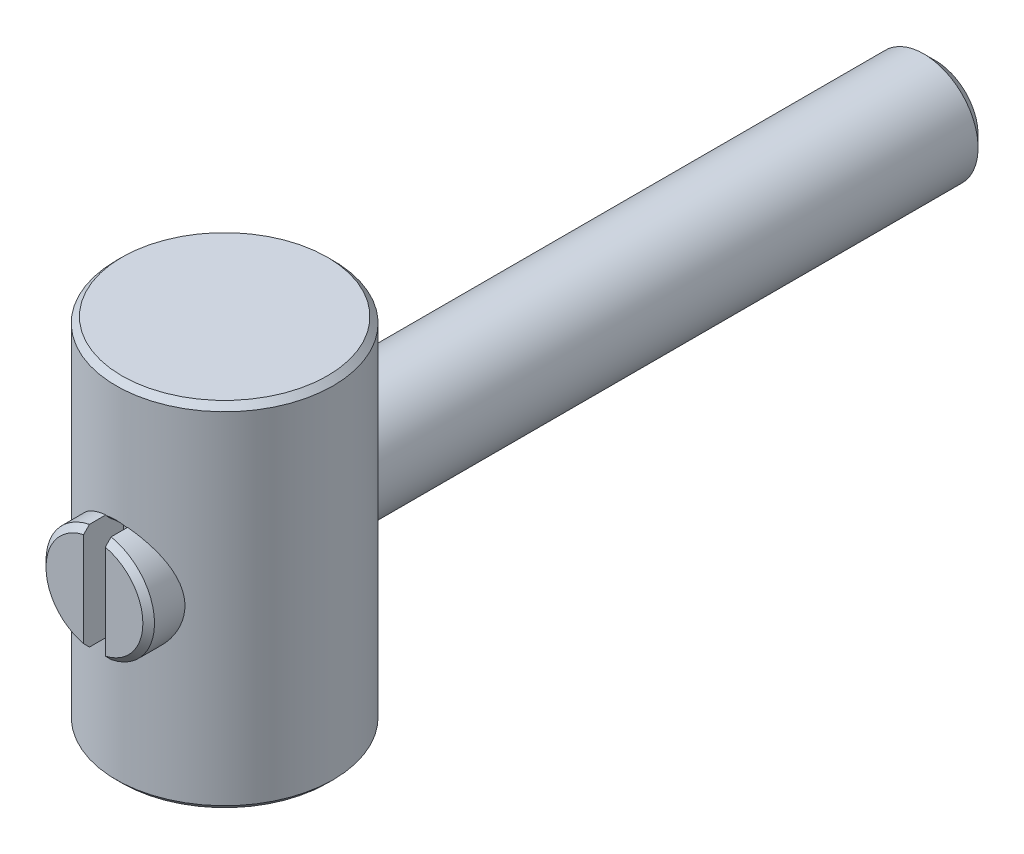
ISO-10303-21;
HEADER;
FILE_DESCRIPTION(('STEP AP214'),'2;1');
FILE_NAME('part.step','',(''),(''),'','','');
FILE_SCHEMA(('AUTOMOTIVE_DESIGN { 1 0 10303 214 1 1 1 1 }'));
ENDSEC;
DATA;
#1=APPLICATION_CONTEXT('core data for automotive mechanical design processes');
#2=APPLICATION_PROTOCOL_DEFINITION('international standard','automotive_design',2000,#1);
#3=PRODUCT_CONTEXT('',#1,'mechanical');
#4=PRODUCT('Part','Part','',(#3));
#5=PRODUCT_RELATED_PRODUCT_CATEGORY('part','',(#4));
#6=PRODUCT_DEFINITION_FORMATION('','',#4);
#7=PRODUCT_DEFINITION_CONTEXT('part definition',#1,'design');
#8=PRODUCT_DEFINITION('design','',#6,#7);
#9=PRODUCT_DEFINITION_SHAPE('','',#8);
#10=(LENGTH_UNIT() NAMED_UNIT(*) SI_UNIT(.MILLI.,.METRE.));
#11=(NAMED_UNIT(*) PLANE_ANGLE_UNIT() SI_UNIT($,.RADIAN.));
#12=(NAMED_UNIT(*) SI_UNIT($,.STERADIAN.) SOLID_ANGLE_UNIT());
#13=UNCERTAINTY_MEASURE_WITH_UNIT(LENGTH_MEASURE(1.E-05),#10,'distance_accuracy_value','');
#14=(GEOMETRIC_REPRESENTATION_CONTEXT(3) GLOBAL_UNCERTAINTY_ASSIGNED_CONTEXT((#13)) GLOBAL_UNIT_ASSIGNED_CONTEXT((#10,
#11,#12)) REPRESENTATION_CONTEXT('',''));
#15=CARTESIAN_POINT('',(0.,0.,0.));
#16=DIRECTION('',(0.,0.,1.));
#17=DIRECTION('',(1.,0.,0.));
#18=AXIS2_PLACEMENT_3D('',#15,#16,#17);
#19=CARTESIAN_POINT('',(0.,0.,4.8));
#20=DIRECTION('',(0.,0.,-1.));
#21=DIRECTION('',(-1.,0.,0.));
#22=AXIS2_PLACEMENT_3D('',#19,#20,#21);
#23=PLANE('',#22);
#24=DIRECTION('',(0.,-1.,0.));
#25=VECTOR('',#24,1.);
#26=CARTESIAN_POINT('',(-0.4,0.,4.8));
#27=LINE('',#26,#25);
#28=CARTESIAN_POINT('',(-0.4,1.74011788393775,4.8));
#29=VERTEX_POINT('',#28);
#30=CARTESIAN_POINT('',(-0.4,-1.74011788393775,4.8));
#31=VERTEX_POINT('',#30);
#32=EDGE_CURVE('E130',#29,#31,#27,.T.);
#33=ORIENTED_EDGE('',*,*,#32,.F.);
#34=CARTESIAN_POINT('',(0.,0.,4.8));
#35=DIRECTION('',(0.,0.,-1.));
#36=DIRECTION('',(-1.,0.,0.));
#37=AXIS2_PLACEMENT_3D('',#34,#35,#36);
#38=CIRCLE('',#37,1.7855);
#39=EDGE_CURVE('E129',#31,#29,#38,.T.);
#40=ORIENTED_EDGE('',*,*,#39,.F.);
#41=EDGE_LOOP('',(#33,#40));
#42=FACE_BOUND('',#41,.T.);
#43=ADVANCED_FACE('F14',(#42),#23,.F.);
#44=CARTESIAN_POINT('',(0.,0.,4.8));
#45=DIRECTION('',(0.,0.,-1.));
#46=DIRECTION('',(-1.,0.,0.));
#47=AXIS2_PLACEMENT_3D('',#44,#45,#46);
#48=CONICAL_SURFACE('',#47,1.7855,0.785398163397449);
#49=CARTESIAN_POINT('',(-0.4,4.38544390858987,2.18185170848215));
#50=CARTESIAN_POINT('',(-0.4,4.22814452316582,2.33849490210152));
#51=CARTESIAN_POINT('',(-0.4,4.07081593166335,2.49510881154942));
#52=CARTESIAN_POINT('',(-0.4,3.75604765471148,2.80824900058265));
#53=CARTESIAN_POINT('',(-0.4,3.59860796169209,2.96477527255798));
#54=CARTESIAN_POINT('',(-0.4,3.28330186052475,3.27797222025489));
#55=CARTESIAN_POINT('',(-0.4,3.12543519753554,3.43464263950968));
#56=CARTESIAN_POINT('',(-0.4,2.80949525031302,3.74775156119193));
#57=CARTESIAN_POINT('',(-0.4,2.65142198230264,3.90419007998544));
#58=CARTESIAN_POINT('',(-0.4,2.34523716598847,4.20651333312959));
#59=CARTESIAN_POINT('',(-0.4,2.19714827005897,4.35242098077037));
#60=CARTESIAN_POINT('',(-0.4,1.9745743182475,4.57086698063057));
#61=CARTESIAN_POINT('',(-0.4,1.90030121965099,4.64362119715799));
#62=CARTESIAN_POINT('',(-0.4,1.75155548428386,4.78892225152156));
#63=CARTESIAN_POINT('',(-0.4,1.67708285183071,4.86146909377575));
#64=CARTESIAN_POINT('',(-0.4,1.52792681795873,5.0061860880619));
#65=CARTESIAN_POINT('',(-0.4,1.45324372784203,5.07835656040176));
#66=CARTESIAN_POINT('',(-0.4,1.303425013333,5.22223884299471));
#67=CARTESIAN_POINT('',(-0.4,1.22828935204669,5.29395061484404));
#68=CARTESIAN_POINT('',(-0.4,1.07732483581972,5.436586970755));
#69=CARTESIAN_POINT('',(-0.4,1.00149626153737,5.50751184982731));
#70=CARTESIAN_POINT('',(-0.4,0.886762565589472,5.61281093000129));
#71=CARTESIAN_POINT('',(-0.4,0.848355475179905,5.64772694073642));
#72=CARTESIAN_POINT('',(-0.4,0.771065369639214,5.71702726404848));
#73=CARTESIAN_POINT('',(-0.4,0.732182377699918,5.75141160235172));
#74=CARTESIAN_POINT('',(-0.4,0.670990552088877,5.80440505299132));
#75=CARTESIAN_POINT('',(-0.4,0.648923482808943,5.82329300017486));
#76=CARTESIAN_POINT('',(-0.4,0.604504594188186,5.86073627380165));
#77=CARTESIAN_POINT('',(-0.4,0.582152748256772,5.87929156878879));
#78=CARTESIAN_POINT('',(-0.4,0.536811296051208,5.91617925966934));
#79=CARTESIAN_POINT('',(-0.4,0.513817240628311,5.9345062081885));
#80=CARTESIAN_POINT('',(-0.4,0.467342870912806,5.97052571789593));
#81=CARTESIAN_POINT('',(-0.4,0.443862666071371,5.98821841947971));
#82=CARTESIAN_POINT('',(-0.4,0.395899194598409,6.02295404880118));
#83=CARTESIAN_POINT('',(-0.4,0.371406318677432,6.0399838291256));
#84=CARTESIAN_POINT('',(-0.4,0.321466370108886,6.07268136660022));
#85=CARTESIAN_POINT('',(-0.4,0.296018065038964,6.08834727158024));
#86=CARTESIAN_POINT('',(-0.4,0.244218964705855,6.11732584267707));
#87=CARTESIAN_POINT('',(-0.4,0.217884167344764,6.13066640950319));
#88=CARTESIAN_POINT('',(-0.4,0.1637878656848,6.15395132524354));
#89=CARTESIAN_POINT('',(-0.4,0.136031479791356,6.16390699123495));
#90=CARTESIAN_POINT('',(-0.4,0.0811637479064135,6.17813666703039));
#91=CARTESIAN_POINT('',(-0.4,0.0541522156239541,6.18277112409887));
#92=CARTESIAN_POINT('',(-0.4,-0.000201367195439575,6.18641177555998));
#93=CARTESIAN_POINT('',(-0.4,-0.0275422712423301,6.18543380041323));
#94=CARTESIAN_POINT('',(-0.4,-0.08124913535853,6.17820280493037));
#95=CARTESIAN_POINT('',(-0.4,-0.107621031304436,6.17199093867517));
#96=CARTESIAN_POINT('',(-0.4,-0.146271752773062,6.15977299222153));
#97=CARTESIAN_POINT('',(-0.4,-0.159041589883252,6.1551986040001));
#98=CARTESIAN_POINT('',(-0.4,-0.184264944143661,6.14525020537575));
#99=CARTESIAN_POINT('',(-0.4,-0.196718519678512,6.13987634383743));
#100=CARTESIAN_POINT('',(-0.4,-0.23353200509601,6.12283069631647));
#101=CARTESIAN_POINT('',(-0.4,-0.257445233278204,6.1102004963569));
#102=CARTESIAN_POINT('',(-0.4,-0.304317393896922,6.08326318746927));
#103=CARTESIAN_POINT('',(-0.4,-0.327275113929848,6.06895403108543));
#104=CARTESIAN_POINT('',(-0.4,-0.37252645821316,6.03916204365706));
#105=CARTESIAN_POINT('',(-0.4,-0.39481743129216,6.0236752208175));
#106=CARTESIAN_POINT('',(-0.4,-0.438833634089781,5.99191398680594));
#107=CARTESIAN_POINT('',(-0.4,-0.460558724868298,5.97563938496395));
#108=CARTESIAN_POINT('',(-0.4,-0.525520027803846,5.92565754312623));
#109=CARTESIAN_POINT('',(-0.4,-0.568098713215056,5.89109840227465));
#110=CARTESIAN_POINT('',(-0.4,-0.631123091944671,5.83837882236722));
#111=CARTESIAN_POINT('',(-0.4,-0.651965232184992,5.82068135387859));
#112=CARTESIAN_POINT('',(-0.4,-0.693435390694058,5.7850382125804));
#113=CARTESIAN_POINT('',(-0.4,-0.714063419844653,5.76709255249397));
#114=CARTESIAN_POINT('',(-0.4,-0.774606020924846,5.71392260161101));
#115=CARTESIAN_POINT('',(-0.4,-0.814284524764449,5.67843014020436));
#116=CARTESIAN_POINT('',(-0.4,-0.893204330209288,5.60696168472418));
#117=CARTESIAN_POINT('',(-0.4,-0.932445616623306,5.57098567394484));
#118=CARTESIAN_POINT('',(-0.4,-1.04971807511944,5.46255349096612));
#119=CARTESIAN_POINT('',(-0.4,-1.12728939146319,5.38960072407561));
#120=CARTESIAN_POINT('',(-0.4,-1.28178514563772,5.24296666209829));
#121=CARTESIAN_POINT('',(-0.4,-1.35870936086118,5.16928513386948));
#122=CARTESIAN_POINT('',(-0.4,-1.51213277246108,5.0214909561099));
#123=CARTESIAN_POINT('',(-0.4,-1.58863199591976,4.94737833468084));
#124=CARTESIAN_POINT('',(-0.4,-1.81796193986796,4.72440140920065));
#125=CARTESIAN_POINT('',(-0.4,-1.97038982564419,4.57512336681));
#126=CARTESIAN_POINT('',(-0.4,-2.27470082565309,4.27606244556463));
#127=CARTESIAN_POINT('',(-0.4,-2.4265840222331,4.12627965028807));
#128=CARTESIAN_POINT('',(-0.4,-2.65349094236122,3.90205377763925));
#129=CARTESIAN_POINT('',(-0.4,-2.72863003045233,3.82772743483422));
#130=CARTESIAN_POINT('',(-0.4,-2.87885103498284,3.67901233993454));
#131=CARTESIAN_POINT('',(-0.4,-2.95393294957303,3.60462358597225));
#132=CARTESIAN_POINT('',(-0.4,-3.17903278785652,3.3814616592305));
#133=CARTESIAN_POINT('',(-0.4,-3.32898065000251,3.23261781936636));
#134=CARTESIAN_POINT('',(-0.4,-3.63002720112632,2.93354169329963));
#135=CARTESIAN_POINT('',(-0.4,-3.78112484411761,2.78330835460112));
#136=CARTESIAN_POINT('',(-0.4,-4.0833055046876,2.48267648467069));
#137=CARTESIAN_POINT('',(-0.4,-4.2343884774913,2.3322779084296));
#138=CARTESIAN_POINT('',(-0.4,-4.38544390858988,2.18185170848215));
#139=B_SPLINE_CURVE_WITH_KNOTS('',3,(#49,#50,#51,#52,#53,#54,#55,#56,#57,#58,#59,#60,#61,#62,
#63,#64,#65,#66,#67,#68,#69,#70,#71,#72,#73,#74,#75,#76,#77,#78,#79,#80,#81,#82,#83,#84,#85,#86,
#87,#88,#89,#90,#91,#92,#93,#94,#95,#96,#97,#98,#99,#100,#101,#102,#103,#104,#105,#106,#107,
#108,#109,#110,#111,#112,#113,#114,#115,#116,#117,#118,#119,#120,#121,#122,#123,#124,#125,#126,
#127,#128,#129,#130,#131,#132,#133,#134,#135,#136,#137,#138),.UNSPECIFIED.,.F.,.F.,(4,2,2,2,2,2,
2,2,2,2,2,2,2,2,2,2,2,2,2,2,2,2,2,2,2,2,2,2,2,2,2,2,2,2,2,2,2,2,2,2,2,2,2,2,4),(0.,
0.665974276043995,1.33199943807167,1.99923802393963,2.6664270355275,3.29010400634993,
3.60201239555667,3.91391408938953,4.22548161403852,4.53707489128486,4.84854710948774,
5.00426229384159,5.15996991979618,5.24710757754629,5.33425343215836,5.42245810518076,
5.51064313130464,5.60010728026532,5.68969108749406,5.77811232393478,5.86623495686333,
5.9479508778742,6.0294364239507,6.1102871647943,6.15096076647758,6.19162680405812,
6.27264196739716,6.35375697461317,6.43516036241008,6.5165835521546,6.68104442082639,
6.76307124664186,6.84509388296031,7.00479619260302,7.16450403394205,7.48395372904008,
7.80350915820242,8.12304398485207,8.76309054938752,9.40303588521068,9.72010458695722,
10.037183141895,10.6710202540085,11.3102423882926,11.9497829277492),.UNSPECIFIED.);
#140=CARTESIAN_POINT('',(-0.4,1.95959179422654,4.5855));
#141=VERTEX_POINT('',#140);
#142=EDGE_CURVE('E111',#141,#29,#139,.T.);
#143=ORIENTED_EDGE('',*,*,#142,.F.);
#144=CARTESIAN_POINT('',(0.,0.,4.5855));
#145=DIRECTION('',(0.,0.,-1.));
#146=DIRECTION('',(-1.,0.,0.));
#147=AXIS2_PLACEMENT_3D('',#144,#145,#146);
#148=CIRCLE('',#147,2.);
#149=CARTESIAN_POINT('',(-0.4,-1.95959179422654,4.5855));
#150=VERTEX_POINT('',#149);
#151=EDGE_CURVE('E127',#150,#141,#148,.T.);
#152=ORIENTED_EDGE('',*,*,#151,.F.);
#153=EDGE_CURVE('E133',#31,#150,#139,.T.);
#154=ORIENTED_EDGE('',*,*,#153,.F.);
#155=ORIENTED_EDGE('',*,*,#39,.T.);
#156=EDGE_LOOP('',(#143,#152,#154,#155));
#157=FACE_BOUND('',#156,.T.);
#158=ADVANCED_FACE('F125',(#157),#48,.T.);
#159=CARTESIAN_POINT('',(0.4,0.,34.8));
#160=DIRECTION('',(-1.,0.,0.));
#161=DIRECTION('',(0.,-1.,0.));
#162=AXIS2_PLACEMENT_3D('',#159,#160,#161);
#163=CYLINDRICAL_SURFACE('',#162,31.5);
#164=CARTESIAN_POINT('',(0.4,-1.76576053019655,3.34952957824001));
#165=CARTESIAN_POINT('',(0.349977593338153,-1.77709824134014,3.35016706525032));
#166=CARTESIAN_POINT('',(0.299469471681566,-1.78629930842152,3.35068890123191));
#167=CARTESIAN_POINT('',(0.197847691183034,-1.80038671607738,3.35149171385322));
#168=CARTESIAN_POINT('',(0.146733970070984,-1.8052726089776,3.35177266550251));
#169=CARTESIAN_POINT('',(0.0452193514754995,-1.81063609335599,3.35208115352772));
#170=CARTESIAN_POINT('',(-0.00517737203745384,-1.81119308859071,3.35211325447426));
#171=CARTESIAN_POINT('',(-0.105833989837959,-1.80810483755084,3.3519355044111));
#172=CARTESIAN_POINT('',(-0.156093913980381,-1.8044605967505,3.35172571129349));
#173=CARTESIAN_POINT('',(-0.238696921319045,-1.79499603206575,3.3511843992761));
#174=CARTESIAN_POINT('',(-0.271182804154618,-1.7903758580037,3.35092073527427));
#175=CARTESIAN_POINT('',(-0.335843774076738,-1.77938039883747,3.35029676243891));
#176=CARTESIAN_POINT('',(-0.368018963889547,-1.77300571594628,3.34993648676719));
#177=CARTESIAN_POINT('',(-0.4,-1.76576053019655,3.34952957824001));
#178=B_SPLINE_CURVE_WITH_KNOTS('',3,(#164,#165,#166,#167,#168,#169,#170,#171,#172,#173,#174,
#175,#176,#177),.UNSPECIFIED.,.F.,.F.,(4,2,2,2,2,2,4),(0.,0.153839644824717,0.307695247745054,
0.458721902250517,0.609712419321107,0.708108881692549,0.806471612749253),.UNSPECIFIED.);
#179=CARTESIAN_POINT('',(0.4,-1.76576053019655,3.34952957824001));
#180=VERTEX_POINT('',#179);
#181=CARTESIAN_POINT('',(-0.4,-1.76576053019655,3.34952957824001));
#182=VERTEX_POINT('',#181);
#183=EDGE_CURVE('E257',#180,#182,#178,.T.);
#184=ORIENTED_EDGE('',*,*,#183,.F.);
#185=CARTESIAN_POINT('',(0.4,0.,34.8));
#186=DIRECTION('',(1.,0.,0.));
#187=DIRECTION('',(0.,1.,0.));
#188=AXIS2_PLACEMENT_3D('',#185,#186,#187);
#189=CIRCLE('',#188,31.5);
#190=CARTESIAN_POINT('',(0.4,1.76576053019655,3.34952957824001));
#191=VERTEX_POINT('',#190);
#192=EDGE_CURVE('E131',#180,#191,#189,.T.);
#193=ORIENTED_EDGE('',*,*,#192,.T.);
#194=CARTESIAN_POINT('',(-0.4,1.76576053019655,3.34952957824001));
#195=CARTESIAN_POINT('',(-0.349977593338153,1.77709824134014,3.35016706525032));
#196=CARTESIAN_POINT('',(-0.299469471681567,1.78629930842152,3.35068890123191));
#197=CARTESIAN_POINT('',(-0.197847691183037,1.80038671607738,3.35149171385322));
#198=CARTESIAN_POINT('',(-0.146733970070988,1.8052726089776,3.35177266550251));
#199=CARTESIAN_POINT('',(-0.0452193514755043,1.81063609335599,3.35208115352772));
#200=CARTESIAN_POINT('',(0.00517737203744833,1.81119308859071,3.35211325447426));
#201=CARTESIAN_POINT('',(0.105833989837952,1.80810483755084,3.3519355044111));
#202=CARTESIAN_POINT('',(0.156093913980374,1.8044605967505,3.35172571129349));
#203=CARTESIAN_POINT('',(0.238696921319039,1.79499603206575,3.3511843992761));
#204=CARTESIAN_POINT('',(0.271182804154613,1.7903758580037,3.35092073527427));
#205=CARTESIAN_POINT('',(0.335843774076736,1.77938039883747,3.35029676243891));
#206=CARTESIAN_POINT('',(0.368018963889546,1.77300571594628,3.34993648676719));
#207=CARTESIAN_POINT('',(0.4,1.76576053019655,3.34952957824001));
#208=B_SPLINE_CURVE_WITH_KNOTS('',3,(#194,#195,#196,#197,#198,#199,#200,#201,#202,#203,#204,
#205,#206,#207),.UNSPECIFIED.,.F.,.F.,(4,2,2,2,2,2,4),(0.,0.153839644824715,0.307695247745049,
0.45872190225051,0.609712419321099,0.708108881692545,0.806471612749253),.UNSPECIFIED.);
#209=CARTESIAN_POINT('',(-0.4,1.76576053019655,3.34952957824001));
#210=VERTEX_POINT('',#209);
#211=EDGE_CURVE('E255',#210,#191,#208,.T.);
#212=ORIENTED_EDGE('',*,*,#211,.F.);
#213=CARTESIAN_POINT('',(-0.4,0.,34.8));
#214=DIRECTION('',(1.,0.,0.));
#215=DIRECTION('',(0.,1.,0.));
#216=AXIS2_PLACEMENT_3D('',#213,#214,#215);
#217=CIRCLE('',#216,31.5);
#218=EDGE_CURVE('E245',#182,#210,#217,.T.);
#219=ORIENTED_EDGE('',*,*,#218,.F.);
#220=EDGE_LOOP('',(#184,#193,#212,#219));
#221=FACE_BOUND('',#220,.T.);
#222=ADVANCED_FACE('F252',(#221),#163,.F.);
#223=CARTESIAN_POINT('',(0.,0.,-4.7));
#224=DIRECTION('',(0.,0.,-1.));
#225=DIRECTION('',(-1.,0.,0.));
#226=AXIS2_PLACEMENT_3D('',#223,#224,#225);
#227=CYLINDRICAL_SURFACE('',#226,2.);
#228=CARTESIAN_POINT('',(-2.,0.,3.46410161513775));
#229=CARTESIAN_POINT('',(-1.99999158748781,0.104213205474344,3.46411185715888));
#230=CARTESIAN_POINT('',(-1.99179963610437,0.208562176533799,3.46887633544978));
#231=CARTESIAN_POINT('',(-1.95944672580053,0.4140551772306,3.48724701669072));
#232=CARTESIAN_POINT('',(-1.93525221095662,0.51519200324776,3.50087179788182));
#233=CARTESIAN_POINT('',(-1.8721998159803,0.710903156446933,3.53498701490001));
#234=CARTESIAN_POINT('',(-1.83341988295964,0.805509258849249,3.55544089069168));
#235=CARTESIAN_POINT('',(-1.74253507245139,0.986848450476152,3.60085327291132));
#236=CARTESIAN_POINT('',(-1.69042947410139,1.07358111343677,3.62581202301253));
#237=CARTESIAN_POINT('',(-1.56933307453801,1.24461144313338,3.67993738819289));
#238=CARTESIAN_POINT('',(-1.49930407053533,1.32811826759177,3.70928127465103));
#239=CARTESIAN_POINT('',(-1.34650761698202,1.4828167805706,3.76743965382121));
#240=CARTESIAN_POINT('',(-1.26373385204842,1.55400232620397,3.79625387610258));
#241=CARTESIAN_POINT('',(-1.08097912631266,1.6867343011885,3.85242953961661));
#242=CARTESIAN_POINT('',(-0.980214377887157,1.74730753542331,3.87956212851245));
#243=CARTESIAN_POINT('',(-0.768314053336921,1.85028170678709,3.92701512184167));
#244=CARTESIAN_POINT('',(-0.65718507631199,1.8926941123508,3.94733982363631));
#245=CARTESIAN_POINT('',(-0.436089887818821,1.95500932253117,3.97760922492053));
#246=CARTESIAN_POINT('',(-0.326603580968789,1.9762990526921,3.9881896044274));
#247=CARTESIAN_POINT('',(-0.105141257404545,2.00033223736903,4.00015167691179));
#248=CARTESIAN_POINT('',(0.00683321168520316,2.00308691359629,4.00153893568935));
#249=CARTESIAN_POINT('',(0.219665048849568,1.99050665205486,3.99525963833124));
#250=CARTESIAN_POINT('',(0.320642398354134,1.97672396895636,3.98836991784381));
#251=CARTESIAN_POINT('',(0.518627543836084,1.93423831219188,3.96748490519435));
#252=CARTESIAN_POINT('',(0.615635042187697,1.90553422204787,3.95348908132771));
#253=CARTESIAN_POINT('',(0.804618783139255,1.83383486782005,3.91943166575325));
#254=CARTESIAN_POINT('',(0.896506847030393,1.79064737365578,3.89928883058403));
#255=CARTESIAN_POINT('',(1.07195360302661,1.6914731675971,3.8547529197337));
#256=CARTESIAN_POINT('',(1.15550929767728,1.63548187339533,3.83035832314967));
#257=CARTESIAN_POINT('',(1.3203473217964,1.50620929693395,3.7768878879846));
#258=CARTESIAN_POINT('',(1.40066815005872,1.43179394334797,3.74758751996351));
#259=CARTESIAN_POINT('',(1.54820874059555,1.27082055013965,3.68908681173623));
#260=CARTESIAN_POINT('',(1.61541842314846,1.18425325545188,3.65988656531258));
#261=CARTESIAN_POINT('',(1.73901066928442,0.994703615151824,3.60288312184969));
#262=CARTESIAN_POINT('',(1.7944346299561,0.891027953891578,3.57528639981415));
#263=CARTESIAN_POINT('',(1.88663822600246,0.674124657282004,3.52750900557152));
#264=CARTESIAN_POINT('',(1.92343731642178,0.560907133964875,3.50732060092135));
#265=CARTESIAN_POINT('',(1.97436042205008,0.337570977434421,3.47889271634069));
#266=CARTESIAN_POINT('',(1.99005024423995,0.227917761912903,3.46983311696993));
#267=CARTESIAN_POINT('',(2.00303389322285,0.00719731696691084,3.46235838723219));
#268=CARTESIAN_POINT('',(2.00034071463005,-0.103868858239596,3.46393573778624));
#269=CARTESIAN_POINT('',(1.97807208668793,-0.311307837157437,3.4766867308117));
#270=CARTESIAN_POINT('',(1.96037563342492,-0.407958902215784,3.48679175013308));
#271=CARTESIAN_POINT('',(1.91139256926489,-0.596735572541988,3.51388043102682));
#272=CARTESIAN_POINT('',(1.88010155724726,-0.688859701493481,3.53086632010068));
#273=CARTESIAN_POINT('',(1.80329517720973,-0.870822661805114,3.57072444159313));
#274=CARTESIAN_POINT('',(1.75718812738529,-0.96035803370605,3.59383286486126));
#275=CARTESIAN_POINT('',(1.65257412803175,-1.13093854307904,3.643122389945));
#276=CARTESIAN_POINT('',(1.59406080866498,-1.21197928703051,3.66930506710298));
#277=CARTESIAN_POINT('',(1.45767433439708,-1.37395753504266,3.72575996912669));
#278=CARTESIAN_POINT('',(1.37829054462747,-1.45359430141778,3.75613166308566));
#279=CARTESIAN_POINT('',(1.20680899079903,-1.59882447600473,3.81468469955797));
#280=CARTESIAN_POINT('',(1.1147069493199,-1.66441314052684,3.84286530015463));
#281=CARTESIAN_POINT('',(0.917070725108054,-1.78114745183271,3.89482723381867));
#282=CARTESIAN_POINT('',(0.81124619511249,-1.83186623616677,3.91847283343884));
#283=CARTESIAN_POINT('',(0.591044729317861,-1.91427580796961,3.95766709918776));
#284=CARTESIAN_POINT('',(0.476675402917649,-1.9459833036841,3.97322287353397));
#285=CARTESIAN_POINT('',(0.25395936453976,-1.98673712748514,3.99335016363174));
#286=CARTESIAN_POINT('',(0.146022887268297,-1.99759574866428,3.9987985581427));
#287=CARTESIAN_POINT('',(-0.0702519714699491,-2.00168653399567,4.00084260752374));
#288=CARTESIAN_POINT('',(-0.178590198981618,-1.99492486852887,3.99744136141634));
#289=CARTESIAN_POINT('',(-0.385075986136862,-1.96516717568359,3.98267937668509));
#290=CARTESIAN_POINT('',(-0.483424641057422,-1.94327026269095,3.97185789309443));
#291=CARTESIAN_POINT('',(-0.674891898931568,-1.88534604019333,3.94384187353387));
#292=CARTESIAN_POINT('',(-0.768009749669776,-1.84931670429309,3.92664642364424));
#293=CARTESIAN_POINT('',(-0.950846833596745,-1.7625457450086,3.8865186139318));
#294=CARTESIAN_POINT('',(-1.0402503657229,-1.71124078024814,3.86337234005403));
#295=CARTESIAN_POINT('',(-1.20954920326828,-1.59608471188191,3.81376266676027));
#296=CARTESIAN_POINT('',(-1.28944011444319,-1.53222784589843,3.78729774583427));
#297=CARTESIAN_POINT('',(-1.44582833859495,-1.38640336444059,3.73057218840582));
#298=CARTESIAN_POINT('',(-1.52119665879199,-1.30326581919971,3.70019591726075));
#299=CARTESIAN_POINT('',(-1.65732528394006,-1.12510777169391,3.64126158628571));
#300=CARTESIAN_POINT('',(-1.71807266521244,-1.03007686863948,3.61270515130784));
#301=CARTESIAN_POINT('',(-1.82486714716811,-0.826691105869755,3.55999186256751));
#302=CARTESIAN_POINT('',(-1.87038902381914,-0.718010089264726,3.53600256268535));
#303=CARTESIAN_POINT('',(-1.92395929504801,-0.549421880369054,3.5069621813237));
#304=CARTESIAN_POINT('',(-1.93935666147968,-0.492352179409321,3.49844389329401));
#305=CARTESIAN_POINT('',(-1.96508069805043,-0.376767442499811,3.48406059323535));
#306=CARTESIAN_POINT('',(-1.97541091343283,-0.318253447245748,3.4781937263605));
#307=CARTESIAN_POINT('',(-1.98872932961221,-0.21639921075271,3.47059023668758));
#308=CARTESIAN_POINT('',(-1.99295091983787,-0.173266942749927,3.46816389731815));
#309=CARTESIAN_POINT('',(-1.99858810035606,-0.0867643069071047,3.46491740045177));
#310=CARTESIAN_POINT('',(-2.00000350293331,-0.0433939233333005,3.46409735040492));
#311=CARTESIAN_POINT('',(-2.,0.,3.46410161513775));
#312=B_SPLINE_CURVE_WITH_KNOTS('',3,(#228,#229,#230,#231,#232,#233,#234,#235,#236,#237,#238,
#239,#240,#241,#242,#243,#244,#245,#246,#247,#248,#249,#250,#251,#252,#253,#254,#255,#256,#257,
#258,#259,#260,#261,#262,#263,#264,#265,#266,#267,#268,#269,#270,#271,#272,#273,#274,#275,#276,
#277,#278,#279,#280,#281,#282,#283,#284,#285,#286,#287,#288,#289,#290,#291,#292,#293,#294,#295,
#296,#297,#298,#299,#300,#301,#302,#303,#304,#305,#306,#307,#308,#309,#310,#311),.UNSPECIFIED.,
.T.,.F.,(4,2,2,2,2,2,2,2,2,2,2,2,2,2,2,2,2,2,2,2,2,2,2,2,2,2,2,2,2,2,2,2,2,2,2,2,2,2,2,2,2,4),
(0.,0.312464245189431,0.625585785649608,0.937057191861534,1.24854545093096,1.58572462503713,
1.92307142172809,2.28315784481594,2.64301653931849,2.97726969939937,3.31132047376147,
3.61632194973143,3.92134625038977,4.2305906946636,4.5399459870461,4.87854382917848,
5.21740096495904,5.57777683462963,5.93777548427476,6.2692458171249,6.60048186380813,
6.89548366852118,7.19058104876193,7.49934592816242,7.80826972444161,8.15613487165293,
8.50411729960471,8.86128362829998,9.2181355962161,9.5422454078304,9.8662417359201,
10.1688884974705,10.4715786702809,10.7872150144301,11.102996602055,11.450204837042,
11.7977188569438,12.1562149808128,12.3351395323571,12.5139387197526,12.6440387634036,
12.7741475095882),.UNSPECIFIED.);
#313=CARTESIAN_POINT('',(-0.4,-1.95959179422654,3.97994974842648));
#314=VERTEX_POINT('',#313);
#315=CARTESIAN_POINT('',(-0.4,1.95959179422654,3.97994974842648));
#316=VERTEX_POINT('',#315);
#317=EDGE_CURVE('E28',#314,#316,#312,.T.);
#318=ORIENTED_EDGE('',*,*,#317,.F.);
#319=DIRECTION('',(0.,0.,-1.));
#320=VECTOR('',#319,1.);
#321=CARTESIAN_POINT('',(-0.4,-1.95959179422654,-4.7));
#322=LINE('',#321,#320);
#323=EDGE_CURVE('E136',#150,#314,#322,.T.);
#324=ORIENTED_EDGE('',*,*,#323,.F.);
#325=ORIENTED_EDGE('',*,*,#151,.T.);
#326=DIRECTION('',(0.,0.,-1.));
#327=VECTOR('',#326,1.);
#328=CARTESIAN_POINT('',(-0.4,1.95959179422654,-4.7));
#329=LINE('',#328,#327);
#330=EDGE_CURVE('E107',#316,#141,#329,.F.);
#331=ORIENTED_EDGE('',*,*,#330,.F.);
#332=EDGE_LOOP('',(#318,#324,#325,#331));
#333=FACE_BOUND('',#332,.T.);
#334=ADVANCED_FACE('F135',(#333),#227,.T.);
#335=CARTESIAN_POINT('',(-0.4,0.,34.8));
#336=DIRECTION('',(1.,0.,0.));
#337=DIRECTION('',(0.,1.,0.));
#338=AXIS2_PLACEMENT_3D('',#335,#336,#337);
#339=PLANE('',#338);
#340=ORIENTED_EDGE('',*,*,#323,.T.);
#341=DIRECTION('',(0.,1.,0.));
#342=VECTOR('',#341,1.);
#343=CARTESIAN_POINT('',(-0.4,6.5,3.97994974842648));
#344=LINE('',#343,#342);
#345=CARTESIAN_POINT('',(-0.4,-1.93912377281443,3.97994974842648));
#346=VERTEX_POINT('',#345);
#347=EDGE_CURVE('E264',#314,#346,#344,.T.);
#348=ORIENTED_EDGE('',*,*,#347,.T.);
#349=CARTESIAN_POINT('',(-0.4,-0.624920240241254,2.74197392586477));
#350=CARTESIAN_POINT('',(-0.4,-0.652653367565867,2.76534479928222));
#351=CARTESIAN_POINT('',(-0.4,-0.680175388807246,2.7889624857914));
#352=CARTESIAN_POINT('',(-0.4,-0.734883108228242,2.83658066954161));
#353=CARTESIAN_POINT('',(-0.4,-0.762068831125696,2.86058113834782));
#354=CARTESIAN_POINT('',(-0.4,-0.843247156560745,2.93298747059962));
#355=CARTESIAN_POINT('',(-0.4,-0.896870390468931,2.98180637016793));
#356=CARTESIAN_POINT('',(-0.4,-1.00349672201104,3.0800847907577));
#357=CARTESIAN_POINT('',(-0.4,-1.05649998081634,3.12954413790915));
#358=CARTESIAN_POINT('',(-0.4,-1.16210748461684,3.22889159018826));
#359=CARTESIAN_POINT('',(-0.4,-1.21471171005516,3.2787797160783));
#360=CARTESIAN_POINT('',(-0.4,-1.34837868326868,3.40624444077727));
#361=CARTESIAN_POINT('',(-0.4,-1.42924950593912,3.48402202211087));
#362=CARTESIAN_POINT('',(-0.4,-1.59060014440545,3.63999652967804));
#363=CARTESIAN_POINT('',(-0.4,-1.67107992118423,3.71819349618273));
#364=CARTESIAN_POINT('',(-0.4,-1.84349823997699,3.88628324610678));
#365=CARTESIAN_POINT('',(-0.4,-1.93539571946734,3.97621812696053));
#366=CARTESIAN_POINT('',(-0.4,-2.11896570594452,4.15631699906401));
#367=CARTESIAN_POINT('',(-0.4,-2.21063821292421,4.24648099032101));
#368=CARTESIAN_POINT('',(-0.4,-2.39380444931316,4.42694304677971));
#369=CARTESIAN_POINT('',(-0.4,-2.48529821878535,4.51724107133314));
#370=CARTESIAN_POINT('',(-0.4,-2.66817104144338,4.69795263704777));
#371=CARTESIAN_POINT('',(-0.4,-2.75955009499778,4.78836617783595));
#372=CARTESIAN_POINT('',(-0.4,-2.85089224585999,4.87881687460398));
#373=B_SPLINE_CURVE_WITH_KNOTS('',3,(#349,#350,#351,#352,#353,#354,#355,#356,#357,#358,#359,
#360,#361,#362,#363,#364,#365,#366,#367,#368,#369,#370,#371,#372),.UNSPECIFIED.,.F.,.F.,(4,2,2,
2,2,2,2,2,2,2,2,4),(0.,0.108797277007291,0.217586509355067,0.435127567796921,0.65261075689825,
0.870104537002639,1.20670989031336,1.54334816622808,1.92909464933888,2.31484114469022,
2.70048799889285,3.08613361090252),.UNSPECIFIED.);
#374=CARTESIAN_POINT('',(-0.4,-1.76576053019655,3.8105));
#375=VERTEX_POINT('',#374);
#376=EDGE_CURVE('E194',#375,#346,#373,.T.);
#377=ORIENTED_EDGE('',*,*,#376,.F.);
#378=DIRECTION('',(0.,0.,-1.));
#379=VECTOR('',#378,1.);
#380=CARTESIAN_POINT('',(-0.4,-1.76576053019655,-4.));
#381=LINE('',#380,#379);
#382=EDGE_CURVE('E329',#182,#375,#381,.F.);
#383=ORIENTED_EDGE('',*,*,#382,.F.);
#384=ORIENTED_EDGE('',*,*,#218,.T.);
#385=DIRECTION('',(0.,0.,-1.));
#386=VECTOR('',#385,1.);
#387=CARTESIAN_POINT('',(-0.4,1.76576053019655,-4.));
#388=LINE('',#387,#386);
#389=CARTESIAN_POINT('',(-0.4,1.76576053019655,3.8105));
#390=VERTEX_POINT('',#389);
#391=EDGE_CURVE('E152',#390,#210,#388,.T.);
#392=ORIENTED_EDGE('',*,*,#391,.F.);
#393=CARTESIAN_POINT('',(-0.4,2.91587738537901,4.94318550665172));
#394=CARTESIAN_POINT('',(-0.4,2.82350327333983,4.85167351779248));
#395=CARTESIAN_POINT('',(-0.4,2.73109369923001,4.76019722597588));
#396=CARTESIAN_POINT('',(-0.4,2.54616753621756,4.57735709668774));
#397=CARTESIAN_POINT('',(-0.4,2.45365094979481,4.48599325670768));
#398=CARTESIAN_POINT('',(-0.4,2.26848279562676,4.30342707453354));
#399=CARTESIAN_POINT('',(-0.4,2.17583124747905,4.21222471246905));
#400=CARTESIAN_POINT('',(-0.4,1.99031330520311,4.03003417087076));
#401=CARTESIAN_POINT('',(-0.4,1.897446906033,3.93904599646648));
#402=CARTESIAN_POINT('',(-0.4,1.71137075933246,3.75737997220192));
#403=CARTESIAN_POINT('',(-0.4,1.61816094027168,3.66670219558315));
#404=CARTESIAN_POINT('',(-0.4,1.43123102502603,3.48588267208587));
#405=CARTESIAN_POINT('',(-0.4,1.33751095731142,3.39574089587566));
#406=CARTESIAN_POINT('',(-0.4,1.19622398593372,3.26124884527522));
#407=CARTESIAN_POINT('',(-0.4,1.14900519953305,3.2165333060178));
#408=CARTESIAN_POINT('',(-0.4,1.05423847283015,3.12745532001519));
#409=CARTESIAN_POINT('',(-0.4,1.00669054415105,3.08309286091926));
#410=CARTESIAN_POINT('',(-0.4,0.911107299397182,2.99487455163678));
#411=CARTESIAN_POINT('',(-0.4,0.863071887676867,2.95101880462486));
#412=CARTESIAN_POINT('',(-0.4,0.790465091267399,2.8858452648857));
#413=CARTESIAN_POINT('',(-0.4,0.766169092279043,2.86422117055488));
#414=CARTESIAN_POINT('',(-0.4,0.717337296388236,2.82124351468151));
#415=CARTESIAN_POINT('',(-0.4,0.69280148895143,2.79988996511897));
#416=CARTESIAN_POINT('',(-0.4,0.668118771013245,2.77870578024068));
#417=B_SPLINE_CURVE_WITH_KNOTS('',3,(#393,#394,#395,#396,#397,#398,#399,#400,#401,#402,#403,
#404,#405,#406,#407,#408,#409,#410,#411,#412,#413,#414,#415,#416),.UNSPECIFIED.,.F.,.F.,(4,2,2,
2,2,2,2,2,2,2,2,4),(0.,0.390085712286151,0.780162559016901,1.17018750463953,1.56022169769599,
1.95034232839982,2.34044141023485,2.53553457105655,2.73062087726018,2.92574622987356,
3.02332045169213,3.12089897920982),.UNSPECIFIED.);
#418=CARTESIAN_POINT('',(-0.4,1.93912377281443,3.97994974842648));
#419=VERTEX_POINT('',#418);
#420=EDGE_CURVE('E154',#419,#390,#417,.T.);
#421=ORIENTED_EDGE('',*,*,#420,.F.);
#422=EDGE_CURVE('E114',#419,#316,#344,.T.);
#423=ORIENTED_EDGE('',*,*,#422,.T.);
#424=ORIENTED_EDGE('',*,*,#330,.T.);
#425=ORIENTED_EDGE('',*,*,#142,.T.);
#426=ORIENTED_EDGE('',*,*,#32,.T.);
#427=ORIENTED_EDGE('',*,*,#153,.T.);
#428=EDGE_LOOP('',(#340,#348,#377,#383,#384,#392,#421,#423,#424,#425,#426,#427));
#429=FACE_BOUND('',#428,.T.);
#430=ADVANCED_FACE('F110',(#429),#339,.T.);
#431=CARTESIAN_POINT('',(0.4,1.74011788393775,4.8));
#432=VERTEX_POINT('',#431);
#433=CARTESIAN_POINT('',(0.4,-1.74011788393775,4.8));
#434=VERTEX_POINT('',#433);
#435=EDGE_CURVE('E120',#432,#434,#38,.T.);
#436=ORIENTED_EDGE('',*,*,#435,.F.);
#437=DIRECTION('',(0.,-1.,0.));
#438=VECTOR('',#437,1.);
#439=CARTESIAN_POINT('',(0.4,0.,4.8));
#440=LINE('',#439,#438);
#441=EDGE_CURVE('E230',#432,#434,#440,.T.);
#442=ORIENTED_EDGE('',*,*,#441,.T.);
#443=EDGE_LOOP('',(#436,#442));
#444=FACE_BOUND('',#443,.T.);
#445=ADVANCED_FACE('F235',(#444),#23,.F.);
#446=CARTESIAN_POINT('',(0.4,1.95959179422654,4.5855));
#447=VERTEX_POINT('',#446);
#448=CARTESIAN_POINT('',(0.4,-1.95959179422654,4.5855));
#449=VERTEX_POINT('',#448);
#450=EDGE_CURVE('E137',#447,#449,#148,.T.);
#451=ORIENTED_EDGE('',*,*,#450,.F.);
#452=CARTESIAN_POINT('',(0.4,4.38544390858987,2.18185170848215));
#453=CARTESIAN_POINT('',(0.4,4.22814452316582,2.33849490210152));
#454=CARTESIAN_POINT('',(0.4,4.07081593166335,2.49510881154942));
#455=CARTESIAN_POINT('',(0.4,3.75604765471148,2.80824900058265));
#456=CARTESIAN_POINT('',(0.4,3.59860796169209,2.96477527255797));
#457=CARTESIAN_POINT('',(0.4,3.28330186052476,3.27797222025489));
#458=CARTESIAN_POINT('',(0.4,3.12543519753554,3.43464263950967));
#459=CARTESIAN_POINT('',(0.4,2.80949525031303,3.74775156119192));
#460=CARTESIAN_POINT('',(0.4,2.65142198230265,3.90419007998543));
#461=CARTESIAN_POINT('',(0.4,2.34523716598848,4.20651333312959));
#462=CARTESIAN_POINT('',(0.4,2.19714827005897,4.35242098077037));
#463=CARTESIAN_POINT('',(0.4,1.97457431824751,4.57086698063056));
#464=CARTESIAN_POINT('',(0.4,1.90030121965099,4.64362119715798));
#465=CARTESIAN_POINT('',(0.4,1.75155548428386,4.78892225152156));
#466=CARTESIAN_POINT('',(0.4,1.67708285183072,4.86146909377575));
#467=CARTESIAN_POINT('',(0.4,1.52792681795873,5.00618608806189));
#468=CARTESIAN_POINT('',(0.4,1.45324372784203,5.07835656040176));
#469=CARTESIAN_POINT('',(0.4,1.303425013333,5.22223884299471));
#470=CARTESIAN_POINT('',(0.4,1.22828935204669,5.29395061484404));
#471=CARTESIAN_POINT('',(0.4,1.07732483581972,5.43658697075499));
#472=CARTESIAN_POINT('',(0.4,1.00149626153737,5.50751184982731));
#473=CARTESIAN_POINT('',(0.4,0.886762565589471,5.61281093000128));
#474=CARTESIAN_POINT('',(0.4,0.848355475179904,5.64772694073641));
#475=CARTESIAN_POINT('',(0.4,0.771065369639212,5.71702726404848));
#476=CARTESIAN_POINT('',(0.4,0.732182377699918,5.75141160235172));
#477=CARTESIAN_POINT('',(0.4,0.670990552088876,5.80440505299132));
#478=CARTESIAN_POINT('',(0.4,0.648923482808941,5.82329300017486));
#479=CARTESIAN_POINT('',(0.4,0.604504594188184,5.86073627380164));
#480=CARTESIAN_POINT('',(0.4,0.582152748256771,5.87929156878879));
#481=CARTESIAN_POINT('',(0.4,0.536811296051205,5.91617925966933));
#482=CARTESIAN_POINT('',(0.4,0.513817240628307,5.9345062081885));
#483=CARTESIAN_POINT('',(0.4,0.467342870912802,5.97052571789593));
#484=CARTESIAN_POINT('',(0.4,0.44386266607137,5.98821841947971));
#485=CARTESIAN_POINT('',(0.4,0.395899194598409,6.02295404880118));
#486=CARTESIAN_POINT('',(0.4,0.371406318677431,6.03998382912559));
#487=CARTESIAN_POINT('',(0.4,0.321466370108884,6.07268136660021));
#488=CARTESIAN_POINT('',(0.4,0.296018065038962,6.08834727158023));
#489=CARTESIAN_POINT('',(0.4,0.244218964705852,6.11732584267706));
#490=CARTESIAN_POINT('',(0.4,0.217884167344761,6.13066640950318));
#491=CARTESIAN_POINT('',(0.4,0.163787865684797,6.15395132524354));
#492=CARTESIAN_POINT('',(0.4,0.136031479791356,6.16390699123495));
#493=CARTESIAN_POINT('',(0.4,0.0811637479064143,6.17813666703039));
#494=CARTESIAN_POINT('',(0.4,0.0541522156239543,6.18277112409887));
#495=CARTESIAN_POINT('',(0.4,-0.000201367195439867,6.18641177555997));
#496=CARTESIAN_POINT('',(0.4,-0.0275422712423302,6.18543380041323));
#497=CARTESIAN_POINT('',(0.4,-0.0812491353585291,6.17820280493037));
#498=CARTESIAN_POINT('',(0.4,-0.107621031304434,6.17199093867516));
#499=CARTESIAN_POINT('',(0.4,-0.14627175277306,6.15977299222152));
#500=CARTESIAN_POINT('',(0.4,-0.15904158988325,6.15519860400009));
#501=CARTESIAN_POINT('',(0.4,-0.184264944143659,6.14525020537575));
#502=CARTESIAN_POINT('',(0.4,-0.196718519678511,6.13987634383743));
#503=CARTESIAN_POINT('',(0.4,-0.233532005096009,6.12283069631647));
#504=CARTESIAN_POINT('',(0.4,-0.257445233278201,6.1102004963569));
#505=CARTESIAN_POINT('',(0.4,-0.304317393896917,6.08326318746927));
#506=CARTESIAN_POINT('',(0.4,-0.327275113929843,6.06895403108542));
#507=CARTESIAN_POINT('',(0.4,-0.372526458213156,6.03916204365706));
#508=CARTESIAN_POINT('',(0.4,-0.394817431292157,6.0236752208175));
#509=CARTESIAN_POINT('',(0.4,-0.438833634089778,5.99191398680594));
#510=CARTESIAN_POINT('',(0.4,-0.460558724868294,5.97563938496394));
#511=CARTESIAN_POINT('',(0.4,-0.525520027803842,5.92565754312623));
#512=CARTESIAN_POINT('',(0.4,-0.568098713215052,5.89109840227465));
#513=CARTESIAN_POINT('',(0.4,-0.631123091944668,5.83837882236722));
#514=CARTESIAN_POINT('',(0.4,-0.651965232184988,5.82068135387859));
#515=CARTESIAN_POINT('',(0.4,-0.693435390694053,5.7850382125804));
#516=CARTESIAN_POINT('',(0.4,-0.714063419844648,5.76709255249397));
#517=CARTESIAN_POINT('',(0.4,-0.77460602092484,5.71392260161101));
#518=CARTESIAN_POINT('',(0.4,-0.814284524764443,5.67843014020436));
#519=CARTESIAN_POINT('',(0.4,-0.89320433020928,5.60696168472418));
#520=CARTESIAN_POINT('',(0.4,-0.932445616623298,5.57098567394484));
#521=CARTESIAN_POINT('',(0.4,-1.04971807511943,5.46255349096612));
#522=CARTESIAN_POINT('',(0.4,-1.12728939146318,5.38960072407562));
#523=CARTESIAN_POINT('',(0.4,-1.2817851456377,5.2429666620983));
#524=CARTESIAN_POINT('',(0.4,-1.35870936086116,5.16928513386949));
#525=CARTESIAN_POINT('',(0.4,-1.51213277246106,5.02149095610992));
#526=CARTESIAN_POINT('',(0.4,-1.58863199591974,4.94737833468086));
#527=CARTESIAN_POINT('',(0.4,-1.81796193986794,4.72440140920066));
#528=CARTESIAN_POINT('',(0.4,-1.97038982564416,4.57512336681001));
#529=CARTESIAN_POINT('',(0.4,-2.27470082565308,4.27606244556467));
#530=CARTESIAN_POINT('',(0.4,-2.4265840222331,4.12627965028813));
#531=CARTESIAN_POINT('',(0.4,-2.65349094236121,3.9020537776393));
#532=CARTESIAN_POINT('',(0.4,-2.7286300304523,3.82772743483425));
#533=CARTESIAN_POINT('',(0.4,-2.87885103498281,3.67901233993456));
#534=CARTESIAN_POINT('',(0.4,-2.95393294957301,3.60462358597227));
#535=CARTESIAN_POINT('',(0.4,-3.1790327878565,3.38146165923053));
#536=CARTESIAN_POINT('',(0.4,-3.32898065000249,3.23261781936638));
#537=CARTESIAN_POINT('',(0.4,-3.6300272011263,2.93354169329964));
#538=CARTESIAN_POINT('',(0.4,-3.78112484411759,2.78330835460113));
#539=CARTESIAN_POINT('',(0.4,-4.0833055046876,2.4826764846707));
#540=CARTESIAN_POINT('',(0.4,-4.23438847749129,2.33227790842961));
#541=CARTESIAN_POINT('',(0.4,-4.38544390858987,2.18185170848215));
#542=B_SPLINE_CURVE_WITH_KNOTS('',3,(#452,#453,#454,#455,#456,#457,#458,#459,#460,#461,#462,
#463,#464,#465,#466,#467,#468,#469,#470,#471,#472,#473,#474,#475,#476,#477,#478,#479,#480,#481,
#482,#483,#484,#485,#486,#487,#488,#489,#490,#491,#492,#493,#494,#495,#496,#497,#498,#499,#500,
#501,#502,#503,#504,#505,#506,#507,#508,#509,#510,#511,#512,#513,#514,#515,#516,#517,#518,#519,
#520,#521,#522,#523,#524,#525,#526,#527,#528,#529,#530,#531,#532,#533,#534,#535,#536,#537,#538,
#539,#540,#541),.UNSPECIFIED.,.F.,.F.,(4,2,2,2,2,2,2,2,2,2,2,2,2,2,2,2,2,2,2,2,2,2,2,2,2,2,2,2,
2,2,2,2,2,2,2,2,2,2,2,2,2,2,2,2,4),(0.,0.665974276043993,1.33199943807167,1.99923802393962,
2.66642703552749,3.29010400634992,3.60201239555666,3.91391408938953,4.22548161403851,
4.53707489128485,4.84854710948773,5.00426229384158,5.15996991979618,5.24710757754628,
5.33425343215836,5.42245810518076,5.51064313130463,5.60010728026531,5.68969108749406,
5.77811232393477,5.86623495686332,5.94795087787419,6.02943642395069,6.1102871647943,
6.15096076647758,6.19162680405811,6.27264196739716,6.35375697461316,6.43516036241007,
6.51658355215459,6.68104442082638,6.76307124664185,6.8450938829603,7.00479619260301,
7.16450403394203,7.48395372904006,7.80350915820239,8.12304398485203,8.76309054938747,
9.40303588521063,9.72010458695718,10.037183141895,10.6710202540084,11.3102423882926,
11.9497829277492),.UNSPECIFIED.);
#543=EDGE_CURVE('E221',#447,#432,#542,.T.);
#544=ORIENTED_EDGE('',*,*,#543,.T.);
#545=ORIENTED_EDGE('',*,*,#435,.T.);
#546=EDGE_CURVE('E231',#434,#449,#542,.T.);
#547=ORIENTED_EDGE('',*,*,#546,.T.);
#548=EDGE_LOOP('',(#451,#544,#545,#547));
#549=FACE_BOUND('',#548,.T.);
#550=ADVANCED_FACE('F232',(#549),#48,.T.);
#551=CARTESIAN_POINT('',(0.4,1.95959179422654,3.97994974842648));
#552=VERTEX_POINT('',#551);
#553=CARTESIAN_POINT('',(0.4,-1.95959179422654,3.97994974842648));
#554=VERTEX_POINT('',#553);
#555=EDGE_CURVE('E9',#552,#554,#312,.T.);
#556=ORIENTED_EDGE('',*,*,#555,.F.);
#557=DIRECTION('',(0.,0.,-1.));
#558=VECTOR('',#557,1.);
#559=CARTESIAN_POINT('',(0.4,1.95959179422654,-4.7));
#560=LINE('',#559,#558);
#561=EDGE_CURVE('E119',#552,#447,#560,.F.);
#562=ORIENTED_EDGE('',*,*,#561,.T.);
#563=ORIENTED_EDGE('',*,*,#450,.T.);
#564=DIRECTION('',(0.,0.,-1.));
#565=VECTOR('',#564,1.);
#566=CARTESIAN_POINT('',(0.4,-1.95959179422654,-4.7));
#567=LINE('',#566,#565);
#568=EDGE_CURVE('E149',#449,#554,#567,.T.);
#569=ORIENTED_EDGE('',*,*,#568,.T.);
#570=EDGE_LOOP('',(#556,#562,#563,#569));
#571=FACE_BOUND('',#570,.T.);
#572=ADVANCED_FACE('F217',(#571),#227,.T.);
#573=CARTESIAN_POINT('',(0.4,0.,34.8));
#574=DIRECTION('',(1.,0.,0.));
#575=DIRECTION('',(0.,1.,0.));
#576=AXIS2_PLACEMENT_3D('',#573,#574,#575);
#577=PLANE('',#576);
#578=DIRECTION('',(0.,1.,0.));
#579=VECTOR('',#578,1.);
#580=CARTESIAN_POINT('',(0.4,6.5,3.97994974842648));
#581=LINE('',#580,#579);
#582=CARTESIAN_POINT('',(0.4,-1.93912377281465,3.97994974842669));
#583=VERTEX_POINT('',#582);
#584=EDGE_CURVE('E206',#554,#583,#581,.T.);
#585=ORIENTED_EDGE('',*,*,#584,.F.);
#586=ORIENTED_EDGE('',*,*,#568,.F.);
#587=ORIENTED_EDGE('',*,*,#546,.F.);
#588=ORIENTED_EDGE('',*,*,#441,.F.);
#589=ORIENTED_EDGE('',*,*,#543,.F.);
#590=ORIENTED_EDGE('',*,*,#561,.F.);
#591=CARTESIAN_POINT('',(0.4,1.93912377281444,3.97994974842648));
#592=VERTEX_POINT('',#591);
#593=EDGE_CURVE('E266',#592,#552,#581,.T.);
#594=ORIENTED_EDGE('',*,*,#593,.F.);
#595=CARTESIAN_POINT('',(0.4,2.91587738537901,4.94318550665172));
#596=CARTESIAN_POINT('',(0.4,2.82350327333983,4.85167351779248));
#597=CARTESIAN_POINT('',(0.4,2.73109369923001,4.76019722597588));
#598=CARTESIAN_POINT('',(0.4,2.54616753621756,4.57735709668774));
#599=CARTESIAN_POINT('',(0.4,2.45365094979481,4.48599325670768));
#600=CARTESIAN_POINT('',(0.4,2.26848279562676,4.30342707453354));
#601=CARTESIAN_POINT('',(0.4,2.17583124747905,4.21222471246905));
#602=CARTESIAN_POINT('',(0.4,1.99031330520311,4.03003417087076));
#603=CARTESIAN_POINT('',(0.4,1.897446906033,3.93904599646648));
#604=CARTESIAN_POINT('',(0.4,1.71137075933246,3.75737997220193));
#605=CARTESIAN_POINT('',(0.4,1.61816094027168,3.66670219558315));
#606=CARTESIAN_POINT('',(0.4,1.43123102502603,3.48588267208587));
#607=CARTESIAN_POINT('',(0.4,1.33751095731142,3.39574089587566));
#608=CARTESIAN_POINT('',(0.4,1.19622398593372,3.26124884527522));
#609=CARTESIAN_POINT('',(0.4,1.14900519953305,3.2165333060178));
#610=CARTESIAN_POINT('',(0.4,1.05423847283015,3.12745532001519));
#611=CARTESIAN_POINT('',(0.4,1.00669054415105,3.08309286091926));
#612=CARTESIAN_POINT('',(0.4,0.911107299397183,2.99487455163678));
#613=CARTESIAN_POINT('',(0.4,0.863071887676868,2.95101880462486));
#614=CARTESIAN_POINT('',(0.4,0.7904650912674,2.8858452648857));
#615=CARTESIAN_POINT('',(0.4,0.766169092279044,2.86422117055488));
#616=CARTESIAN_POINT('',(0.4,0.717337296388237,2.82124351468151));
#617=CARTESIAN_POINT('',(0.4,0.692801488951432,2.79988996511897));
#618=CARTESIAN_POINT('',(0.4,0.668118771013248,2.77870578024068));
#619=B_SPLINE_CURVE_WITH_KNOTS('',3,(#595,#596,#597,#598,#599,#600,#601,#602,#603,#604,#605,
#606,#607,#608,#609,#610,#611,#612,#613,#614,#615,#616,#617,#618),.UNSPECIFIED.,.F.,.F.,(4,2,2,
2,2,2,2,2,2,2,2,4),(0.,0.390085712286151,0.780162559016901,1.17018750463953,1.56022169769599,
1.95034232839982,2.34044141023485,2.53553457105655,2.73062087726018,2.92574622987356,
3.02332045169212,3.12089897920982),.UNSPECIFIED.);
#620=CARTESIAN_POINT('',(0.4,1.76576053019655,3.8105));
#621=VERTEX_POINT('',#620);
#622=EDGE_CURVE('E208',#592,#621,#619,.T.);
#623=ORIENTED_EDGE('',*,*,#622,.T.);
#624=DIRECTION('',(0.,0.,-1.));
#625=VECTOR('',#624,1.);
#626=CARTESIAN_POINT('',(0.4,1.76576053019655,-4.));
#627=LINE('',#626,#625);
#628=EDGE_CURVE('E259',#621,#191,#627,.T.);
#629=ORIENTED_EDGE('',*,*,#628,.T.);
#630=ORIENTED_EDGE('',*,*,#192,.F.);
#631=DIRECTION('',(0.,0.,-1.));
#632=VECTOR('',#631,1.);
#633=CARTESIAN_POINT('',(0.4,-1.76576053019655,-4.));
#634=LINE('',#633,#632);
#635=CARTESIAN_POINT('',(0.4,-1.76576053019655,3.8105));
#636=VERTEX_POINT('',#635);
#637=EDGE_CURVE('E41',#180,#636,#634,.F.);
#638=ORIENTED_EDGE('',*,*,#637,.T.);
#639=CARTESIAN_POINT('',(0.4,-0.624920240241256,2.74197392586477));
#640=CARTESIAN_POINT('',(0.4,-0.652653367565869,2.76534479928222));
#641=CARTESIAN_POINT('',(0.4,-0.680175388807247,2.7889624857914));
#642=CARTESIAN_POINT('',(0.4,-0.734883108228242,2.83658066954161));
#643=CARTESIAN_POINT('',(0.4,-0.762068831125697,2.86058113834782));
#644=CARTESIAN_POINT('',(0.4,-0.843247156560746,2.93298747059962));
#645=CARTESIAN_POINT('',(0.4,-0.896870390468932,2.98180637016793));
#646=CARTESIAN_POINT('',(0.4,-1.00349672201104,3.0800847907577));
#647=CARTESIAN_POINT('',(0.4,-1.05649998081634,3.12954413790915));
#648=CARTESIAN_POINT('',(0.4,-1.16210748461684,3.22889159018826));
#649=CARTESIAN_POINT('',(0.4,-1.21471171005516,3.2787797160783));
#650=CARTESIAN_POINT('',(0.4,-1.34837868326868,3.40624444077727));
#651=CARTESIAN_POINT('',(0.4,-1.42924950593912,3.48402202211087));
#652=CARTESIAN_POINT('',(0.4,-1.59060014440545,3.63999652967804));
#653=CARTESIAN_POINT('',(0.4,-1.67107992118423,3.71819349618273));
#654=CARTESIAN_POINT('',(0.4,-1.84349823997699,3.88628324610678));
#655=CARTESIAN_POINT('',(0.4,-1.93539571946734,3.97621812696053));
#656=CARTESIAN_POINT('',(0.4,-2.11896570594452,4.15631699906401));
#657=CARTESIAN_POINT('',(0.4,-2.21063821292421,4.24648099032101));
#658=CARTESIAN_POINT('',(0.4,-2.39380444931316,4.42694304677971));
#659=CARTESIAN_POINT('',(0.4,-2.48529821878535,4.51724107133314));
#660=CARTESIAN_POINT('',(0.4,-2.66817104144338,4.69795263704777));
#661=CARTESIAN_POINT('',(0.4,-2.75955009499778,4.78836617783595));
#662=CARTESIAN_POINT('',(0.4,-2.85089224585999,4.87881687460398));
#663=B_SPLINE_CURVE_WITH_KNOTS('',3,(#639,#640,#641,#642,#643,#644,#645,#646,#647,#648,#649,
#650,#651,#652,#653,#654,#655,#656,#657,#658,#659,#660,#661,#662),.UNSPECIFIED.,.F.,.F.,(4,2,2,
2,2,2,2,2,2,2,2,4),(0.,0.10879727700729,0.217586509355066,0.43512756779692,0.652610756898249,
0.870104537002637,1.20670989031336,1.54334816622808,1.92909464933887,2.31484114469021,
2.70048799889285,3.08613361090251),.UNSPECIFIED.);
#664=EDGE_CURVE('E36',#636,#583,#663,.T.);
#665=ORIENTED_EDGE('',*,*,#664,.T.);
#666=EDGE_LOOP('',(#585,#586,#587,#588,#589,#590,#594,#623,#629,#630,#638,#665));
#667=FACE_BOUND('',#666,.T.);
#668=ADVANCED_FACE('F213',(#667),#577,.F.);
#669=CARTESIAN_POINT('',(0.,0.,-25.7705));
#670=DIRECTION('',(0.,0.,-1.));
#671=DIRECTION('',(-1.,0.,0.));
#672=AXIS2_PLACEMENT_3D('',#669,#670,#671);
#673=CIRCLE('',#672,2.);
#674=CARTESIAN_POINT('',(-2.,0.,-25.7705));
#675=VERTEX_POINT('',#674);
#676=EDGE_CURVE('E138',#675,#675,#673,.T.);
#677=ORIENTED_EDGE('',*,*,#676,.F.);
#678=EDGE_LOOP('',(#677));
#679=FACE_BOUND('',#678,.T.);
#680=CARTESIAN_POINT('',(-2.,0.,-3.46410161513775));
#681=CARTESIAN_POINT('',(-1.99999158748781,-0.104213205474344,-3.46411185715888));
#682=CARTESIAN_POINT('',(-1.99179963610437,-0.208562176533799,-3.46887633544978));
#683=CARTESIAN_POINT('',(-1.95944672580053,-0.4140551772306,-3.48724701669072));
#684=CARTESIAN_POINT('',(-1.93525221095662,-0.51519200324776,-3.50087179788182));
#685=CARTESIAN_POINT('',(-1.8721998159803,-0.710903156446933,-3.53498701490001));
#686=CARTESIAN_POINT('',(-1.83341988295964,-0.805509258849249,-3.55544089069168));
#687=CARTESIAN_POINT('',(-1.74253507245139,-0.986848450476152,-3.60085327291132));
#688=CARTESIAN_POINT('',(-1.69042947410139,-1.07358111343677,-3.62581202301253));
#689=CARTESIAN_POINT('',(-1.56933307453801,-1.24461144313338,-3.67993738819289));
#690=CARTESIAN_POINT('',(-1.49930407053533,-1.32811826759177,-3.70928127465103));
#691=CARTESIAN_POINT('',(-1.34650761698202,-1.4828167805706,-3.76743965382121));
#692=CARTESIAN_POINT('',(-1.26373385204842,-1.55400232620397,-3.79625387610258));
#693=CARTESIAN_POINT('',(-1.08097912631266,-1.6867343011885,-3.85242953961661));
#694=CARTESIAN_POINT('',(-0.980214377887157,-1.74730753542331,-3.87956212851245));
#695=CARTESIAN_POINT('',(-0.768314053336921,-1.85028170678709,-3.92701512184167));
#696=CARTESIAN_POINT('',(-0.65718507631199,-1.8926941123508,-3.94733982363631));
#697=CARTESIAN_POINT('',(-0.436089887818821,-1.95500932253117,-3.97760922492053));
#698=CARTESIAN_POINT('',(-0.326603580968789,-1.9762990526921,-3.9881896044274));
#699=CARTESIAN_POINT('',(-0.105141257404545,-2.00033223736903,-4.00015167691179));
#700=CARTESIAN_POINT('',(0.00683321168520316,-2.00308691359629,-4.00153893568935));
#701=CARTESIAN_POINT('',(0.219665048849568,-1.99050665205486,-3.99525963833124));
#702=CARTESIAN_POINT('',(0.320642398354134,-1.97672396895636,-3.98836991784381));
#703=CARTESIAN_POINT('',(0.518627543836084,-1.93423831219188,-3.96748490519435));
#704=CARTESIAN_POINT('',(0.615635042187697,-1.90553422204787,-3.95348908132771));
#705=CARTESIAN_POINT('',(0.804618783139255,-1.83383486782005,-3.91943166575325));
#706=CARTESIAN_POINT('',(0.896506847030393,-1.79064737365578,-3.89928883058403));
#707=CARTESIAN_POINT('',(1.07195360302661,-1.6914731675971,-3.8547529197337));
#708=CARTESIAN_POINT('',(1.15550929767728,-1.63548187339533,-3.83035832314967));
#709=CARTESIAN_POINT('',(1.3203473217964,-1.50620929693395,-3.7768878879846));
#710=CARTESIAN_POINT('',(1.40066815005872,-1.43179394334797,-3.74758751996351));
#711=CARTESIAN_POINT('',(1.54820874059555,-1.27082055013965,-3.68908681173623));
#712=CARTESIAN_POINT('',(1.61541842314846,-1.18425325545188,-3.65988656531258));
#713=CARTESIAN_POINT('',(1.73901066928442,-0.994703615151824,-3.60288312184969));
#714=CARTESIAN_POINT('',(1.7944346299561,-0.891027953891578,-3.57528639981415));
#715=CARTESIAN_POINT('',(1.88663822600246,-0.674124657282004,-3.52750900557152));
#716=CARTESIAN_POINT('',(1.92343731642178,-0.560907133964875,-3.50732060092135));
#717=CARTESIAN_POINT('',(1.97436042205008,-0.337570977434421,-3.47889271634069));
#718=CARTESIAN_POINT('',(1.99005024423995,-0.227917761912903,-3.46983311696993));
#719=CARTESIAN_POINT('',(2.00303389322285,-0.00719731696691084,-3.46235838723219));
#720=CARTESIAN_POINT('',(2.00034071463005,0.103868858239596,-3.46393573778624));
#721=CARTESIAN_POINT('',(1.97807208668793,0.311307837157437,-3.4766867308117));
#722=CARTESIAN_POINT('',(1.96037563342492,0.407958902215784,-3.48679175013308));
#723=CARTESIAN_POINT('',(1.91139256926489,0.596735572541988,-3.51388043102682));
#724=CARTESIAN_POINT('',(1.88010155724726,0.688859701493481,-3.53086632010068));
#725=CARTESIAN_POINT('',(1.80329517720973,0.870822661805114,-3.57072444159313));
#726=CARTESIAN_POINT('',(1.75718812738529,0.96035803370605,-3.59383286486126));
#727=CARTESIAN_POINT('',(1.65257412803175,1.13093854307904,-3.643122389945));
#728=CARTESIAN_POINT('',(1.59406080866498,1.21197928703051,-3.66930506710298));
#729=CARTESIAN_POINT('',(1.45767433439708,1.37395753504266,-3.72575996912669));
#730=CARTESIAN_POINT('',(1.37829054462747,1.45359430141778,-3.75613166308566));
#731=CARTESIAN_POINT('',(1.20680899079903,1.59882447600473,-3.81468469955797));
#732=CARTESIAN_POINT('',(1.1147069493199,1.66441314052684,-3.84286530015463));
#733=CARTESIAN_POINT('',(0.917070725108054,1.78114745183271,-3.89482723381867));
#734=CARTESIAN_POINT('',(0.81124619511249,1.83186623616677,-3.91847283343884));
#735=CARTESIAN_POINT('',(0.591044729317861,1.91427580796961,-3.95766709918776));
#736=CARTESIAN_POINT('',(0.476675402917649,1.9459833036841,-3.97322287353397));
#737=CARTESIAN_POINT('',(0.25395936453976,1.98673712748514,-3.99335016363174));
#738=CARTESIAN_POINT('',(0.146022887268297,1.99759574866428,-3.9987985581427));
#739=CARTESIAN_POINT('',(-0.0702519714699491,2.00168653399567,-4.00084260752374));
#740=CARTESIAN_POINT('',(-0.178590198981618,1.99492486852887,-3.99744136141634));
#741=CARTESIAN_POINT('',(-0.385075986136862,1.96516717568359,-3.98267937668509));
#742=CARTESIAN_POINT('',(-0.483424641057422,1.94327026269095,-3.97185789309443));
#743=CARTESIAN_POINT('',(-0.674891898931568,1.88534604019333,-3.94384187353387));
#744=CARTESIAN_POINT('',(-0.768009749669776,1.84931670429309,-3.92664642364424));
#745=CARTESIAN_POINT('',(-0.950846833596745,1.7625457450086,-3.8865186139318));
#746=CARTESIAN_POINT('',(-1.0402503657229,1.71124078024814,-3.86337234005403));
#747=CARTESIAN_POINT('',(-1.20954920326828,1.59608471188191,-3.81376266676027));
#748=CARTESIAN_POINT('',(-1.28944011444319,1.53222784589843,-3.78729774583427));
#749=CARTESIAN_POINT('',(-1.44582833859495,1.38640336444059,-3.73057218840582));
#750=CARTESIAN_POINT('',(-1.52119665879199,1.30326581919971,-3.70019591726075));
#751=CARTESIAN_POINT('',(-1.65732528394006,1.12510777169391,-3.64126158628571));
#752=CARTESIAN_POINT('',(-1.71807266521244,1.03007686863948,-3.61270515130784));
#753=CARTESIAN_POINT('',(-1.82486714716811,0.826691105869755,-3.55999186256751));
#754=CARTESIAN_POINT('',(-1.87038902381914,0.718010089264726,-3.53600256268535));
#755=CARTESIAN_POINT('',(-1.92395929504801,0.549421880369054,-3.5069621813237));
#756=CARTESIAN_POINT('',(-1.93935666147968,0.492352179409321,-3.49844389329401));
#757=CARTESIAN_POINT('',(-1.96508069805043,0.376767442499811,-3.48406059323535));
#758=CARTESIAN_POINT('',(-1.97541091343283,0.318253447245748,-3.4781937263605));
#759=CARTESIAN_POINT('',(-1.98872932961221,0.21639921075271,-3.47059023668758));
#760=CARTESIAN_POINT('',(-1.99295091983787,0.173266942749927,-3.46816389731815));
#761=CARTESIAN_POINT('',(-1.99858810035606,0.0867643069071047,-3.46491740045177));
#762=CARTESIAN_POINT('',(-2.00000350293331,0.0433939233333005,-3.46409735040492));
#763=CARTESIAN_POINT('',(-2.,0.,-3.46410161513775));
#764=B_SPLINE_CURVE_WITH_KNOTS('',3,(#680,#681,#682,#683,#684,#685,#686,#687,#688,#689,#690,
#691,#692,#693,#694,#695,#696,#697,#698,#699,#700,#701,#702,#703,#704,#705,#706,#707,#708,#709,
#710,#711,#712,#713,#714,#715,#716,#717,#718,#719,#720,#721,#722,#723,#724,#725,#726,#727,#728,
#729,#730,#731,#732,#733,#734,#735,#736,#737,#738,#739,#740,#741,#742,#743,#744,#745,#746,#747,
#748,#749,#750,#751,#752,#753,#754,#755,#756,#757,#758,#759,#760,#761,#762,#763),.UNSPECIFIED.,
.T.,.F.,(4,2,2,2,2,2,2,2,2,2,2,2,2,2,2,2,2,2,2,2,2,2,2,2,2,2,2,2,2,2,2,2,2,2,2,2,2,2,2,2,2,4),
(0.,0.312464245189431,0.625585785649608,0.937057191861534,1.24854545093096,1.58572462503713,
1.92307142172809,2.28315784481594,2.64301653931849,2.97726969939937,3.31132047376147,
3.61632194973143,3.92134625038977,4.2305906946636,4.5399459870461,4.87854382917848,
5.21740096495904,5.57777683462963,5.93777548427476,6.2692458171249,6.60048186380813,
6.89548366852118,7.19058104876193,7.49934592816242,7.80826972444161,8.15613487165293,
8.50411729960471,8.86128362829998,9.2181355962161,9.5422454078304,9.8662417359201,
10.1688884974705,10.4715786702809,10.7872150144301,11.102996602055,11.450204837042,
11.7977188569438,12.1562149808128,12.3351395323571,12.5139387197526,12.6440387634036,
12.7741475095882),.UNSPECIFIED.);
#765=CARTESIAN_POINT('',(-2.,0.,-3.46410161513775));
#766=VERTEX_POINT('',#765);
#767=EDGE_CURVE('E18',#766,#766,#764,.T.);
#768=ORIENTED_EDGE('',*,*,#767,.F.);
#769=EDGE_LOOP('',(#768));
#770=FACE_BOUND('',#769,.T.);
#771=ADVANCED_FACE('F216',(#679,#770),#227,.T.);
#772=CARTESIAN_POINT('',(0.,0.,-25.7705));
#773=DIRECTION('',(0.,0.,1.));
#774=DIRECTION('',(1.,0.,0.));
#775=AXIS2_PLACEMENT_3D('',#772,#773,#774);
#776=CONICAL_SURFACE('',#775,2.,0.785398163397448);
#777=CARTESIAN_POINT('',(0.,0.,-26.2));
#778=DIRECTION('',(0.,0.,-1.));
#779=DIRECTION('',(-1.,0.,0.));
#780=AXIS2_PLACEMENT_3D('',#777,#778,#779);
#781=CIRCLE('',#780,1.5705);
#782=CARTESIAN_POINT('',(-1.5705,0.,-26.2));
#783=VERTEX_POINT('',#782);
#784=EDGE_CURVE('E142',#783,#783,#781,.T.);
#785=ORIENTED_EDGE('',*,*,#784,.F.);
#786=EDGE_LOOP('',(#785));
#787=FACE_BOUND('',#786,.T.);
#788=ORIENTED_EDGE('',*,*,#676,.T.);
#789=EDGE_LOOP('',(#788));
#790=FACE_BOUND('',#789,.T.);
#791=ADVANCED_FACE('F281',(#787,#790),#776,.T.);
#792=CARTESIAN_POINT('',(0.,1.5705,-26.2));
#793=DIRECTION('',(0.,0.,1.));
#794=DIRECTION('',(1.,0.,0.));
#795=AXIS2_PLACEMENT_3D('',#792,#793,#794);
#796=PLANE('',#795);
#797=ORIENTED_EDGE('',*,*,#784,.T.);
#798=EDGE_LOOP('',(#797));
#799=FACE_BOUND('',#798,.T.);
#800=ADVANCED_FACE('F274',(#799),#796,.F.);
#801=CARTESIAN_POINT('',(0.,6.5,3.78786796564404));
#802=DIRECTION('',(0.,-1.,0.));
#803=DIRECTION('',(1.,0.,0.));
#804=AXIS2_PLACEMENT_3D('',#801,#802,#803);
#805=PLANE('',#804);
#806=CARTESIAN_POINT('',(0.,6.5,0.));
#807=DIRECTION('',(0.,1.,0.));
#808=DIRECTION('',(-1.,0.,0.));
#809=AXIS2_PLACEMENT_3D('',#806,#807,#808);
#810=CIRCLE('',#809,3.78786796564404);
#811=CARTESIAN_POINT('',(-3.78786796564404,6.5,0.));
#812=VERTEX_POINT('',#811);
#813=EDGE_CURVE('E303',#812,#812,#810,.T.);
#814=ORIENTED_EDGE('',*,*,#813,.T.);
#815=EDGE_LOOP('',(#814));
#816=FACE_BOUND('',#815,.T.);
#817=ADVANCED_FACE('F178',(#816),#805,.F.);
#818=CARTESIAN_POINT('',(0.,-6.5,0.));
#819=DIRECTION('',(0.,1.,0.));
#820=DIRECTION('',(-1.,0.,0.));
#821=AXIS2_PLACEMENT_3D('',#818,#819,#820);
#822=PLANE('',#821);
#823=CARTESIAN_POINT('',(0.,-6.5,0.));
#824=DIRECTION('',(0.,1.,0.));
#825=DIRECTION('',(-1.,0.,0.));
#826=AXIS2_PLACEMENT_3D('',#823,#824,#825);
#827=CIRCLE('',#826,3.78786796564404);
#828=CARTESIAN_POINT('',(-3.78786796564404,-6.5,0.));
#829=VERTEX_POINT('',#828);
#830=EDGE_CURVE('E315',#829,#829,#827,.T.);
#831=ORIENTED_EDGE('',*,*,#830,.F.);
#832=EDGE_LOOP('',(#831));
#833=FACE_BOUND('',#832,.T.);
#834=ADVANCED_FACE('F16',(#833),#822,.F.);
#835=CARTESIAN_POINT('',(0.,6.28786796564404,0.));
#836=DIRECTION('',(0.,-1.,0.));
#837=DIRECTION('',(1.,0.,0.));
#838=AXIS2_PLACEMENT_3D('',#835,#836,#837);
#839=CONICAL_SURFACE('',#838,4.,0.785398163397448);
#840=ORIENTED_EDGE('',*,*,#813,.F.);
#841=EDGE_LOOP('',(#840));
#842=FACE_BOUND('',#841,.T.);
#843=CARTESIAN_POINT('',(0.,6.28786796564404,0.));
#844=DIRECTION('',(0.,1.,0.));
#845=DIRECTION('',(-1.,0.,0.));
#846=AXIS2_PLACEMENT_3D('',#843,#844,#845);
#847=CIRCLE('',#846,4.);
#848=CARTESIAN_POINT('',(-4.,6.28786796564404,0.));
#849=VERTEX_POINT('',#848);
#850=EDGE_CURVE('E305',#849,#849,#847,.T.);
#851=ORIENTED_EDGE('',*,*,#850,.T.);
#852=EDGE_LOOP('',(#851));
#853=FACE_BOUND('',#852,.T.);
#854=ADVANCED_FACE('F299',(#842,#853),#839,.T.);
#855=CARTESIAN_POINT('',(0.,-6.5,0.));
#856=DIRECTION('',(0.,1.,0.));
#857=DIRECTION('',(-1.,0.,0.));
#858=AXIS2_PLACEMENT_3D('',#855,#856,#857);
#859=CONICAL_SURFACE('',#858,3.78786796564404,0.785398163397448);
#860=CARTESIAN_POINT('',(0.,-6.28786796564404,0.));
#861=DIRECTION('',(0.,1.,0.));
#862=DIRECTION('',(-1.,0.,0.));
#863=AXIS2_PLACEMENT_3D('',#860,#861,#862);
#864=CIRCLE('',#863,4.);
#865=CARTESIAN_POINT('',(-4.,-6.28786796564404,0.));
#866=VERTEX_POINT('',#865);
#867=EDGE_CURVE('E309',#866,#866,#864,.T.);
#868=ORIENTED_EDGE('',*,*,#867,.F.);
#869=EDGE_LOOP('',(#868));
#870=FACE_BOUND('',#869,.T.);
#871=ORIENTED_EDGE('',*,*,#830,.T.);
#872=EDGE_LOOP('',(#871));
#873=FACE_BOUND('',#872,.T.);
#874=ADVANCED_FACE('F339',(#870,#873),#859,.T.);
#875=CARTESIAN_POINT('',(0.,6.5,0.));
#876=DIRECTION('',(0.,1.,0.));
#877=DIRECTION('',(-1.,0.,0.));
#878=AXIS2_PLACEMENT_3D('',#875,#876,#877);
#879=CYLINDRICAL_SURFACE('',#878,4.);
#880=ORIENTED_EDGE('',*,*,#867,.T.);
#881=EDGE_LOOP('',(#880));
#882=FACE_BOUND('',#881,.T.);
#883=ORIENTED_EDGE('',*,*,#850,.F.);
#884=EDGE_LOOP('',(#883));
#885=FACE_BOUND('',#884,.T.);
#886=ORIENTED_EDGE('',*,*,#555,.T.);
#887=ORIENTED_EDGE('',*,*,#584,.T.);
#888=CARTESIAN_POINT('',(1.63806221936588,0.191452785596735,3.64921254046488));
#889=CARTESIAN_POINT('',(1.63311902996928,0.252892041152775,3.6514203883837));
#890=CARTESIAN_POINT('',(1.62578825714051,0.314096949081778,3.6547097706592));
#891=CARTESIAN_POINT('',(1.60639104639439,0.435631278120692,3.66328291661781));
#892=CARTESIAN_POINT('',(1.59432305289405,0.495960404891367,3.66856733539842));
#893=CARTESIAN_POINT('',(1.56554595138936,0.615081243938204,3.68093794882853));
#894=CARTESIAN_POINT('',(1.54885365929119,0.673877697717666,3.68801760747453));
#895=CARTESIAN_POINT('',(1.5108693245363,0.789721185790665,3.70374099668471));
#896=CARTESIAN_POINT('',(1.48957916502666,0.846768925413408,3.71238408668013));
#897=CARTESIAN_POINT('',(1.43978841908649,0.965029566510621,3.7319972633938));
#898=CARTESIAN_POINT('',(1.41074659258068,1.02599075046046,3.7431196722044));
#899=CARTESIAN_POINT('',(1.34707109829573,1.14469970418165,3.76650359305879));
#900=CARTESIAN_POINT('',(1.31243624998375,1.20244679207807,3.77876534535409));
#901=CARTESIAN_POINT('',(1.22658963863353,1.33053512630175,3.80763588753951));
#902=CARTESIAN_POINT('',(1.17349836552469,1.3995853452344,3.82446254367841));
#903=CARTESIAN_POINT('',(1.05809955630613,1.52964261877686,3.85798307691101));
#904=CARTESIAN_POINT('',(0.995788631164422,1.59064670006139,3.87467690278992));
#905=CARTESIAN_POINT('',(0.864836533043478,1.70043049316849,3.90594526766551));
#906=CARTESIAN_POINT('',(0.796530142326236,1.74958954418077,3.92057655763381));
#907=CARTESIAN_POINT('',(0.652438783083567,1.83642314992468,3.94710982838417));
#908=CARTESIAN_POINT('',(0.576657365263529,1.87410312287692,3.9590130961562));
#909=CARTESIAN_POINT('',(0.418437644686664,1.93596372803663,3.97885728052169));
#910=CARTESIAN_POINT('',(0.335948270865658,1.96002699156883,3.98676368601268));
#911=CARTESIAN_POINT('',(0.167596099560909,1.9921610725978,3.99737328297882));
#912=CARTESIAN_POINT('',(0.0817368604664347,2.00024831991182,4.00008181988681));
#913=CARTESIAN_POINT('',(-0.0779089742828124,1.9997747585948,3.999925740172));
#914=CARTESIAN_POINT('',(-0.151711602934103,1.99337564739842,3.99778475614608));
#915=CARTESIAN_POINT('',(-0.297060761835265,1.96869254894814,3.98961803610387));
#916=CARTESIAN_POINT('',(-0.368607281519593,1.95040850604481,3.98359228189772));
#917=CARTESIAN_POINT('',(-0.506696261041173,1.90341038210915,3.96837881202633));
#918=CARTESIAN_POINT('',(-0.573292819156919,1.87483896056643,3.95923443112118));
#919=CARTESIAN_POINT('',(-0.701410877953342,1.80862664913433,3.93855832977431));
#920=CARTESIAN_POINT('',(-0.762928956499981,1.77097970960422,3.92702501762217));
#921=CARTESIAN_POINT('',(-0.888817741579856,1.68193253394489,3.90060625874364));
#922=CARTESIAN_POINT('',(-0.952277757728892,1.62932395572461,3.88547727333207));
#923=CARTESIAN_POINT('',(-1.07107658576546,1.51597126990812,3.85442176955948));
#924=CARTESIAN_POINT('',(-1.12642176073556,1.45523360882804,3.83849588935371));
#925=CARTESIAN_POINT('',(-1.21194439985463,1.34832622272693,3.81214851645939));
#926=CARTESIAN_POINT('',(-1.24440131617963,1.30396072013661,3.80164437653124));
#927=CARTESIAN_POINT('',(-1.34092403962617,1.15993764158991,3.76918775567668));
#928=CARTESIAN_POINT('',(-1.39829288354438,1.05550113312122,3.74799771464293));
#929=CARTESIAN_POINT('',(-1.49562902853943,0.837797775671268,3.71023371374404));
#930=CARTESIAN_POINT('',(-1.53554633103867,0.724506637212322,3.69367306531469));
#931=CARTESIAN_POINT('',(-1.59760298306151,0.491743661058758,3.66726271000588));
#932=CARTESIAN_POINT('',(-1.61964982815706,0.372243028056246,3.65744796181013));
#933=CARTESIAN_POINT('',(-1.64524644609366,0.131012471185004,3.64600685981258));
#934=CARTESIAN_POINT('',(-1.64881467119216,0.0092848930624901,3.64437233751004));
#935=CARTESIAN_POINT('',(-1.63737385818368,-0.2345372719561,3.64952682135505));
#936=CARTESIAN_POINT('',(-1.62214809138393,-0.356619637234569,3.65641410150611));
#937=CARTESIAN_POINT('',(-1.57299772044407,-0.596367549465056,3.67782363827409));
#938=CARTESIAN_POINT('',(-1.5390571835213,-0.71402924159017,3.69235239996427));
#939=CARTESIAN_POINT('',(-1.45271965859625,-0.941985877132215,3.72716721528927));
#940=CARTESIAN_POINT('',(-1.40025359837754,-1.05225138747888,3.74747475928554));
#941=CARTESIAN_POINT('',(-1.27718320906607,-1.26149394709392,3.79118110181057));
#942=CARTESIAN_POINT('',(-1.20659444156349,-1.36048057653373,3.81457723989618));
#943=CARTESIAN_POINT('',(-1.06625147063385,-1.52162679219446,3.85579117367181));
#944=CARTESIAN_POINT('',(-1.00016766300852,-1.58698363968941,3.87363313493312));
#945=CARTESIAN_POINT('',(-0.857948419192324,-1.70619705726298,3.90758815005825));
#946=CARTESIAN_POINT('',(-0.78182831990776,-1.76007085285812,3.92370377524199));
#947=CARTESIAN_POINT('',(-0.634620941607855,-1.84532097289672,3.94991515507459));
#948=CARTESIAN_POINT('',(-0.56496032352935,-1.87898038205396,3.96057040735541));
#949=CARTESIAN_POINT('',(-0.420721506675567,-1.93474545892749,3.97847433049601));
#950=CARTESIAN_POINT('',(-0.346146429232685,-1.95685838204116,3.98572514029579));
#951=CARTESIAN_POINT('',(-0.193610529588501,-1.98815872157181,3.99604549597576));
#952=CARTESIAN_POINT('',(-0.115634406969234,-1.99727977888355,3.99909357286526));
#953=CARTESIAN_POINT('',(0.0407483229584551,-2.00166860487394,4.00055592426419));
#954=CARTESIAN_POINT('',(0.119154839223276,-1.99693919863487,3.99897114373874));
#955=CARTESIAN_POINT('',(0.267189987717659,-1.97498872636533,3.9916969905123));
#956=CARTESIAN_POINT('',(0.337002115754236,-1.95885217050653,3.98636419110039));
#957=CARTESIAN_POINT('',(0.473051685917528,-1.91626906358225,3.97251844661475));
#958=CARTESIAN_POINT('',(0.539288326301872,-1.88982021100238,3.96400479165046));
#959=CARTESIAN_POINT('',(0.671070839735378,-1.82593216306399,3.94390570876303));
#960=CARTESIAN_POINT('',(0.736300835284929,-1.78789761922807,3.93215848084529));
#961=CARTESIAN_POINT('',(0.860521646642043,-1.70326193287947,3.90685663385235));
#962=CARTESIAN_POINT('',(0.919509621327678,-1.6566569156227,3.8933011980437));
#963=CARTESIAN_POINT('',(1.04119896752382,-1.54700380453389,3.86271174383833));
#964=CARTESIAN_POINT('',(1.1025501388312,-1.48250965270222,3.8454996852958));
#965=CARTESIAN_POINT('',(1.21565143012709,-1.34553204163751,3.81125821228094));
#966=CARTESIAN_POINT('',(1.26739260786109,-1.2730412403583,3.79422898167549));
#967=CARTESIAN_POINT('',(1.37087431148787,-1.10600269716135,3.75823128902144));
#968=CARTESIAN_POINT('',(1.42038612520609,-1.00999961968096,3.73959384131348));
#969=CARTESIAN_POINT('',(1.50497755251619,-0.811223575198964,3.7063612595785));
#970=CARTESIAN_POINT('',(1.54006320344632,-0.708453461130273,3.69176443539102));
#971=CARTESIAN_POINT('',(1.58301712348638,-0.545932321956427,3.67346222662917));
#972=CARTESIAN_POINT('',(1.5960219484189,-0.487705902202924,3.66781485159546));
#973=CARTESIAN_POINT('',(1.61756228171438,-0.370392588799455,3.65836262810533));
#974=CARTESIAN_POINT('',(1.62610567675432,-0.31130740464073,3.65455452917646));
#975=CARTESIAN_POINT('',(1.63241767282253,-0.251914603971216,3.65174102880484));
#976=B_SPLINE_CURVE_WITH_KNOTS('',3,(#888,#889,#890,#891,#892,#893,#894,#895,#896,#897,#898,
#899,#900,#901,#902,#903,#904,#905,#906,#907,#908,#909,#910,#911,#912,#913,#914,#915,#916,#917,
#918,#919,#920,#921,#922,#923,#924,#925,#926,#927,#928,#929,#930,#931,#932,#933,#934,#935,#936,
#937,#938,#939,#940,#941,#942,#943,#944,#945,#946,#947,#948,#949,#950,#951,#952,#953,#954,#955,
#956,#957,#958,#959,#960,#961,#962,#963,#964,#965,#966,#967,#968,#969,#970,#971,#972,#973,#974,
#975),.UNSPECIFIED.,.F.,.F.,(4,2,2,2,2,2,2,2,2,2,2,2,2,2,2,2,2,2,2,2,2,2,2,2,2,2,2,2,2,2,2,2,2,
2,2,2,2,2,2,2,2,2,2,4),(0.,0.184971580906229,0.370003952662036,0.554372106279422,
0.738664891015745,0.943654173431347,1.14868678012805,1.41402087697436,1.67945275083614,
1.93469635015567,2.18981928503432,2.44710899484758,2.70413396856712,2.92536335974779,
3.14659378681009,3.36486754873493,3.58328721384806,3.83382435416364,4.08416397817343,
4.25191792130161,4.61306692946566,4.97524395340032,5.33928398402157,5.70296042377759,
6.07087017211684,6.43909362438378,6.80870474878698,7.17799955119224,7.46087334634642,
7.74331977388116,7.9766500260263,8.2098334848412,8.44420376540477,8.67852624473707,
8.89313318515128,9.10778804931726,9.33618932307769,9.56469411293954,9.83570259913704,
10.1069620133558,10.4345178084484,10.7619363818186,10.9415399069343,11.1208248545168),.UNSPECIFIED.);
#977=EDGE_CURVE('E317',#346,#583,#976,.T.);
#978=ORIENTED_EDGE('',*,*,#977,.F.);
#979=ORIENTED_EDGE('',*,*,#347,.F.);
#980=ORIENTED_EDGE('',*,*,#317,.T.);
#981=ORIENTED_EDGE('',*,*,#422,.F.);
#982=EDGE_CURVE('E183',#592,#419,#976,.T.);
#983=ORIENTED_EDGE('',*,*,#982,.F.);
#984=ORIENTED_EDGE('',*,*,#593,.T.);
#985=EDGE_LOOP('',(#886,#887,#978,#979,#980,#981,#983,#984));
#986=FACE_BOUND('',#985,.T.);
#987=ORIENTED_EDGE('',*,*,#767,.T.);
#988=EDGE_LOOP('',(#987));
#989=FACE_BOUND('',#988,.T.);
#990=ADVANCED_FACE('F326',(#882,#885,#986,#989),#879,.T.);
#991=CARTESIAN_POINT('',(0.,0.,4.));
#992=DIRECTION('',(0.,0.,1.));
#993=DIRECTION('',(1.,0.,0.));
#994=AXIS2_PLACEMENT_3D('',#991,#992,#993);
#995=CONICAL_SURFACE('',#994,2.,0.785398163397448);
#996=ORIENTED_EDGE('',*,*,#664,.F.);
#997=CARTESIAN_POINT('',(0.,0.,3.8105));
#998=DIRECTION('',(0.,0.,-1.));
#999=DIRECTION('',(-1.,0.,0.));
#1000=AXIS2_PLACEMENT_3D('',#997,#998,#999);
#1001=CIRCLE('',#1000,1.8105);
#1002=EDGE_CURVE('E306',#636,#375,#1001,.T.);
#1003=ORIENTED_EDGE('',*,*,#1002,.T.);
#1004=ORIENTED_EDGE('',*,*,#376,.T.);
#1005=ORIENTED_EDGE('',*,*,#977,.T.);
#1006=EDGE_LOOP('',(#996,#1003,#1004,#1005));
#1007=FACE_BOUND('',#1006,.T.);
#1008=ADVANCED_FACE('F175',(#1007),#995,.F.);
#1009=CARTESIAN_POINT('',(0.,0.,-4.));
#1010=DIRECTION('',(0.,0.,-1.));
#1011=DIRECTION('',(-1.,0.,0.));
#1012=AXIS2_PLACEMENT_3D('',#1009,#1010,#1011);
#1013=CYLINDRICAL_SURFACE('',#1012,1.8105);
#1014=ORIENTED_EDGE('',*,*,#637,.F.);
#1015=ORIENTED_EDGE('',*,*,#183,.T.);
#1016=ORIENTED_EDGE('',*,*,#382,.T.);
#1017=ORIENTED_EDGE('',*,*,#1002,.F.);
#1018=EDGE_LOOP('',(#1014,#1015,#1016,#1017));
#1019=FACE_BOUND('',#1018,.T.);
#1020=ADVANCED_FACE('F173',(#1019),#1013,.F.);
#1021=ORIENTED_EDGE('',*,*,#622,.F.);
#1022=ORIENTED_EDGE('',*,*,#982,.T.);
#1023=ORIENTED_EDGE('',*,*,#420,.T.);
#1024=EDGE_CURVE('E312',#390,#621,#1001,.T.);
#1025=ORIENTED_EDGE('',*,*,#1024,.T.);
#1026=EDGE_LOOP('',(#1021,#1022,#1023,#1025));
#1027=FACE_BOUND('',#1026,.T.);
#1028=ADVANCED_FACE('F167',(#1027),#995,.F.);
#1029=ORIENTED_EDGE('',*,*,#628,.F.);
#1030=ORIENTED_EDGE('',*,*,#1024,.F.);
#1031=ORIENTED_EDGE('',*,*,#391,.T.);
#1032=ORIENTED_EDGE('',*,*,#211,.T.);
#1033=EDGE_LOOP('',(#1029,#1030,#1031,#1032));
#1034=FACE_BOUND('',#1033,.T.);
#1035=ADVANCED_FACE('F172',(#1034),#1013,.F.);
#1036=CLOSED_SHELL('',(#43,#158,#222,#334,#430,#445,#550,#572,#668,#771,#791,#800,#817,#834,
#854,#874,#990,#1008,#1020,#1028,#1035));
#1037=MANIFOLD_SOLID_BREP('B1',#1036);
#1038=ADVANCED_BREP_SHAPE_REPRESENTATION('',(#18,#1037),#14);
#1039=SHAPE_DEFINITION_REPRESENTATION(#9,#1038);
ENDSEC;
END-ISO-10303-21;
